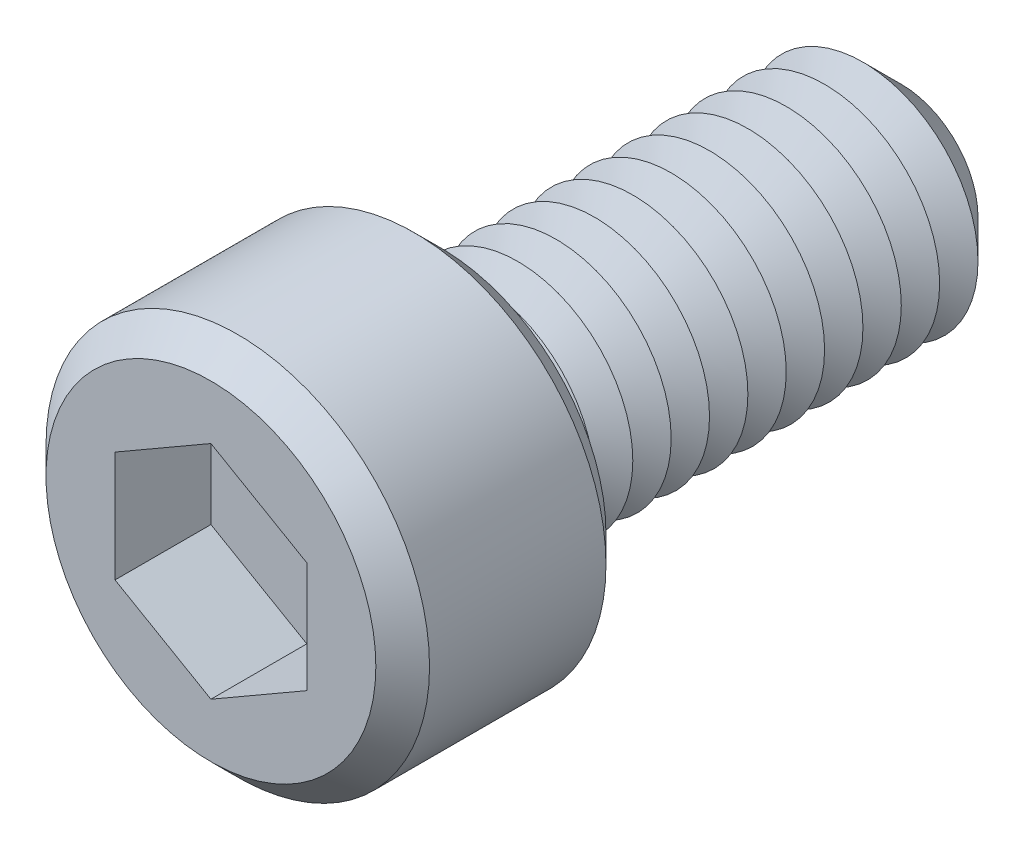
from build123d import *

# Parameters (mm, degrees)
SKETCH1_R           = 5
BOSS_EXTRUDE1_DEPTH = 6
SKETCH2_R           = 3
BOSS_EXTRUDE2_DEPTH = 12
CHAMFER1_SIZE       = 1
LPATTERN1_COUNT     = 11
LPATTERN1_PITCH     = 1
CUT_EXTRUDE1_DEPTH  = 2.5
SKETCH6_R           = 0.8
CUT_EXTRUDE2_DEPTH  = 15.5
CHAMFER2_SIZE       = 0.7


with BuildPart() as part:
    # Sketch1 → Boss-Extrude1 (new body)
    with BuildSketch(Plane.XY):
        Circle(SKETCH1_R)
    extrude(amount=BOSS_EXTRUDE1_DEPTH)

    # Sketch2 → Boss-Extrude2 (add)
    with BuildSketch(Plane(origin=(0, 0, 0), x_dir=(-1, 0, 0), z_dir=(0, 0, -1))):
        Circle(SKETCH2_R)
    extrude(amount=BOSS_EXTRUDE2_DEPTH)

    # Chamfer1
    chamfer1_edges = [part.edges().sort_by_distance(p)[0] for p in [
        (3, 0, -12),
    ]]
    chamfer(chamfer1_edges, length=CHAMFER1_SIZE)

    # Sketch4 → Cut-Revolve1 (revolve, cut)
    with BuildSketch(Plane(origin=(0, 0, 0), x_dir=(0, 0, -1), z_dir=(1, 0, 0)), mode=Mode.PRIVATE) as cut_revolve1_sk:
        Polygon((0, 3), (0.5, 2.133974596), (1, 3), align=None)
    cut_revolve1 = revolve(cut_revolve1_sk.sketch.rotate(Axis((0, 0, 2.512122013), (0, 0, -1)), 90), axis=Axis((0, 0, 2.512122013), (0, 0, -1)), mode=Mode.SUBTRACT)

    # LPattern1: Cut-Revolve1 ×11
    with Locations(*[(0, 0, -i * LPATTERN1_PITCH) for i in range(1, LPATTERN1_COUNT)]):
        add(cut_revolve1, mode=Mode.SUBTRACT)

    # Sketch5 → Cut-Extrude1 (cut)
    with BuildSketch(Plane.XY.offset(6)):
        Polygon((0, 2.886751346), (-2.5, 1.443375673), (-2.5, -1.443375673), (0, -2.886751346), (2.5, -1.443375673), (2.5, 1.443375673), align=None)
    extrude(amount=-CUT_EXTRUDE1_DEPTH, mode=Mode.SUBTRACT)

    # Sketch6 → Cut-Extrude2 (cut)
    with BuildSketch(Plane.XY.offset(3.5)):
        Circle(SKETCH6_R)
    extrude(amount=-CUT_EXTRUDE2_DEPTH, mode=Mode.SUBTRACT)

    # Chamfer2
    chamfer2_edges = [part.edges().sort_by_distance(p)[0] for p in [
        (-5, 0, 0),
        (-5, 0, 6),
    ]]
    chamfer(chamfer2_edges, length=CHAMFER2_SIZE)


solid = part.part
